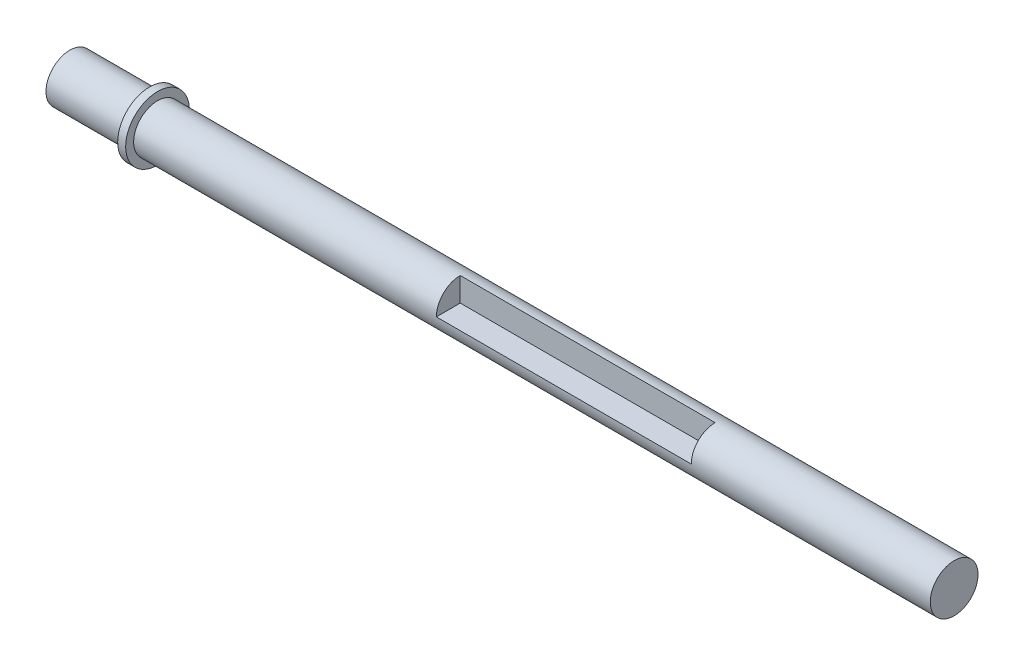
ISO-10303-21;
HEADER;
FILE_DESCRIPTION(('STEP AP214'),'2;1');
FILE_NAME('part.step','',(''),(''),'','','');
FILE_SCHEMA(('AUTOMOTIVE_DESIGN { 1 0 10303 214 1 1 1 1 }'));
ENDSEC;
DATA;
#1=APPLICATION_CONTEXT('core data for automotive mechanical design processes');
#2=APPLICATION_PROTOCOL_DEFINITION('international standard','automotive_design',2000,#1);
#3=PRODUCT_CONTEXT('',#1,'mechanical');
#4=PRODUCT('Part','Part','',(#3));
#5=PRODUCT_RELATED_PRODUCT_CATEGORY('part','',(#4));
#6=PRODUCT_DEFINITION_FORMATION('','',#4);
#7=PRODUCT_DEFINITION_CONTEXT('part definition',#1,'design');
#8=PRODUCT_DEFINITION('design','',#6,#7);
#9=PRODUCT_DEFINITION_SHAPE('','',#8);
#10=(LENGTH_UNIT() NAMED_UNIT(*) SI_UNIT(.MILLI.,.METRE.));
#11=(NAMED_UNIT(*) PLANE_ANGLE_UNIT() SI_UNIT($,.RADIAN.));
#12=(NAMED_UNIT(*) SI_UNIT($,.STERADIAN.) SOLID_ANGLE_UNIT());
#13=UNCERTAINTY_MEASURE_WITH_UNIT(LENGTH_MEASURE(1.E-05),#10,'distance_accuracy_value','');
#14=(GEOMETRIC_REPRESENTATION_CONTEXT(3) GLOBAL_UNCERTAINTY_ASSIGNED_CONTEXT((#13)) GLOBAL_UNIT_ASSIGNED_CONTEXT((#10,
#11,#12)) REPRESENTATION_CONTEXT('',''));
#15=CARTESIAN_POINT('',(0.,0.,0.));
#16=DIRECTION('',(0.,0.,1.));
#17=DIRECTION('',(1.,0.,0.));
#18=AXIS2_PLACEMENT_3D('',#15,#16,#17);
#19=CARTESIAN_POINT('',(0.,0.,0.));
#20=DIRECTION('',(-1.,0.,0.));
#21=DIRECTION('',(0.,0.,1.));
#22=AXIS2_PLACEMENT_3D('',#19,#20,#21);
#23=CYLINDRICAL_SURFACE('',#22,3.);
#24=CARTESIAN_POINT('',(111.,0.,0.));
#25=DIRECTION('',(-1.,0.,0.));
#26=DIRECTION('',(0.,0.,1.));
#27=AXIS2_PLACEMENT_3D('',#24,#25,#26);
#28=CIRCLE('',#27,3.);
#29=CARTESIAN_POINT('',(111.,0.,3.));
#30=VERTEX_POINT('',#29);
#31=EDGE_CURVE('E85',#30,#30,#28,.T.);
#32=ORIENTED_EDGE('',*,*,#31,.T.);
#33=EDGE_LOOP('',(#32));
#34=FACE_BOUND('',#33,.T.);
#35=CARTESIAN_POINT('',(11.,0.,0.));
#36=DIRECTION('',(-1.,0.,0.));
#37=DIRECTION('',(0.,0.,1.));
#38=AXIS2_PLACEMENT_3D('',#35,#36,#37);
#39=CIRCLE('',#38,3.);
#40=CARTESIAN_POINT('',(11.,0.,3.));
#41=VERTEX_POINT('',#40);
#42=EDGE_CURVE('E89',#41,#41,#39,.T.);
#43=ORIENTED_EDGE('',*,*,#42,.F.);
#44=EDGE_LOOP('',(#43));
#45=FACE_BOUND('',#44,.T.);
#46=CARTESIAN_POINT('',(49.,0.,0.));
#47=DIRECTION('',(1.,0.,0.));
#48=DIRECTION('',(0.,0.,-1.));
#49=AXIS2_PLACEMENT_3D('',#46,#47,#48);
#50=CIRCLE('',#49,3.);
#51=CARTESIAN_POINT('',(49.,3.,0.));
#52=VERTEX_POINT('',#51);
#53=CARTESIAN_POINT('',(49.,0.,3.));
#54=VERTEX_POINT('',#53);
#55=EDGE_CURVE('E68',#52,#54,#50,.T.);
#56=ORIENTED_EDGE('',*,*,#55,.F.);
#57=DIRECTION('',(1.,0.,0.));
#58=VECTOR('',#57,1.);
#59=CARTESIAN_POINT('',(49.,3.,0.));
#60=LINE('',#59,#58);
#61=CARTESIAN_POINT('',(81.,3.,0.));
#62=VERTEX_POINT('',#61);
#63=EDGE_CURVE('E67',#52,#62,#60,.T.);
#64=ORIENTED_EDGE('',*,*,#63,.T.);
#65=CARTESIAN_POINT('',(81.,0.,0.));
#66=DIRECTION('',(1.,0.,0.));
#67=DIRECTION('',(0.,0.,-1.));
#68=AXIS2_PLACEMENT_3D('',#65,#66,#67);
#69=CIRCLE('',#68,3.);
#70=CARTESIAN_POINT('',(81.,0.,3.));
#71=VERTEX_POINT('',#70);
#72=EDGE_CURVE('E72',#62,#71,#69,.T.);
#73=ORIENTED_EDGE('',*,*,#72,.T.);
#74=DIRECTION('',(1.,0.,0.));
#75=VECTOR('',#74,1.);
#76=CARTESIAN_POINT('',(49.,0.,3.));
#77=LINE('',#76,#75);
#78=EDGE_CURVE('E77',#54,#71,#77,.T.);
#79=ORIENTED_EDGE('',*,*,#78,.F.);
#80=EDGE_LOOP('',(#56,#64,#73,#79));
#81=FACE_BOUND('',#80,.T.);
#82=ADVANCED_FACE('F26',(#34,#45,#81),#23,.T.);
#83=CARTESIAN_POINT('',(0.,0.,0.));
#84=DIRECTION('',(1.,0.,0.));
#85=DIRECTION('',(0.,0.,-1.));
#86=AXIS2_PLACEMENT_3D('',#83,#84,#85);
#87=PLANE('',#86);
#88=CARTESIAN_POINT('',(0.,0.,0.));
#89=DIRECTION('',(-1.,0.,0.));
#90=DIRECTION('',(0.,0.,1.));
#91=AXIS2_PLACEMENT_3D('',#88,#89,#90);
#92=CIRCLE('',#91,3.);
#93=CARTESIAN_POINT('',(0.,0.,3.));
#94=VERTEX_POINT('',#93);
#95=EDGE_CURVE('E11',#94,#94,#92,.T.);
#96=ORIENTED_EDGE('',*,*,#95,.T.);
#97=EDGE_LOOP('',(#96));
#98=FACE_BOUND('',#97,.T.);
#99=ADVANCED_FACE('F28',(#98),#87,.F.);
#100=CARTESIAN_POINT('',(0.,0.,0.));
#101=DIRECTION('',(-1.,0.,0.));
#102=DIRECTION('',(0.,0.,1.));
#103=AXIS2_PLACEMENT_3D('',#100,#101,#102);
#104=CYLINDRICAL_SURFACE('',#103,3.);
#105=ORIENTED_EDGE('',*,*,#95,.F.);
#106=EDGE_LOOP('',(#105));
#107=FACE_BOUND('',#106,.T.);
#108=CARTESIAN_POINT('',(10.,0.,0.));
#109=DIRECTION('',(-1.,0.,0.));
#110=DIRECTION('',(0.,0.,1.));
#111=AXIS2_PLACEMENT_3D('',#108,#109,#110);
#112=CIRCLE('',#111,3.);
#113=CARTESIAN_POINT('',(10.,0.,3.));
#114=VERTEX_POINT('',#113);
#115=EDGE_CURVE('E34',#114,#114,#112,.T.);
#116=ORIENTED_EDGE('',*,*,#115,.T.);
#117=EDGE_LOOP('',(#116));
#118=FACE_BOUND('',#117,.T.);
#119=ADVANCED_FACE('F100',(#107,#118),#104,.T.);
#120=CARTESIAN_POINT('',(10.,3.,0.));
#121=DIRECTION('',(1.,0.,0.));
#122=DIRECTION('',(0.,0.,-1.));
#123=AXIS2_PLACEMENT_3D('',#120,#121,#122);
#124=PLANE('',#123);
#125=ORIENTED_EDGE('',*,*,#115,.F.);
#126=EDGE_LOOP('',(#125));
#127=FACE_BOUND('',#126,.T.);
#128=CARTESIAN_POINT('',(10.,0.,0.));
#129=DIRECTION('',(-1.,0.,0.));
#130=DIRECTION('',(0.,0.,1.));
#131=AXIS2_PLACEMENT_3D('',#128,#129,#130);
#132=CIRCLE('',#131,4.);
#133=CARTESIAN_POINT('',(10.,0.,4.));
#134=VERTEX_POINT('',#133);
#135=EDGE_CURVE('E95',#134,#134,#132,.T.);
#136=ORIENTED_EDGE('',*,*,#135,.T.);
#137=EDGE_LOOP('',(#136));
#138=FACE_BOUND('',#137,.T.);
#139=ADVANCED_FACE('F102',(#127,#138),#124,.F.);
#140=CARTESIAN_POINT('',(0.,0.,0.));
#141=DIRECTION('',(-1.,0.,0.));
#142=DIRECTION('',(0.,0.,1.));
#143=AXIS2_PLACEMENT_3D('',#140,#141,#142);
#144=CYLINDRICAL_SURFACE('',#143,4.);
#145=ORIENTED_EDGE('',*,*,#135,.F.);
#146=EDGE_LOOP('',(#145));
#147=FACE_BOUND('',#146,.T.);
#148=CARTESIAN_POINT('',(11.,0.,0.));
#149=DIRECTION('',(-1.,0.,0.));
#150=DIRECTION('',(0.,0.,1.));
#151=AXIS2_PLACEMENT_3D('',#148,#149,#150);
#152=CIRCLE('',#151,4.);
#153=CARTESIAN_POINT('',(11.,0.,4.));
#154=VERTEX_POINT('',#153);
#155=EDGE_CURVE('E92',#154,#154,#152,.T.);
#156=ORIENTED_EDGE('',*,*,#155,.T.);
#157=EDGE_LOOP('',(#156));
#158=FACE_BOUND('',#157,.T.);
#159=ADVANCED_FACE('F105',(#147,#158),#144,.T.);
#160=CARTESIAN_POINT('',(11.,4.,0.));
#161=DIRECTION('',(-1.,0.,0.));
#162=DIRECTION('',(0.,0.,1.));
#163=AXIS2_PLACEMENT_3D('',#160,#161,#162);
#164=PLANE('',#163);
#165=ORIENTED_EDGE('',*,*,#155,.F.);
#166=EDGE_LOOP('',(#165));
#167=FACE_BOUND('',#166,.T.);
#168=ORIENTED_EDGE('',*,*,#42,.T.);
#169=EDGE_LOOP('',(#168));
#170=FACE_BOUND('',#169,.T.);
#171=ADVANCED_FACE('F111',(#167,#170),#164,.F.);
#172=CARTESIAN_POINT('',(111.,3.,0.));
#173=DIRECTION('',(-1.,0.,0.));
#174=DIRECTION('',(0.,0.,1.));
#175=AXIS2_PLACEMENT_3D('',#172,#173,#174);
#176=PLANE('',#175);
#177=ORIENTED_EDGE('',*,*,#31,.F.);
#178=EDGE_LOOP('',(#177));
#179=FACE_BOUND('',#178,.T.);
#180=ADVANCED_FACE('F117',(#179),#176,.F.);
#181=CARTESIAN_POINT('',(49.,0.,0.));
#182=DIRECTION('',(0.,-1.,0.));
#183=DIRECTION('',(0.,0.,-1.));
#184=AXIS2_PLACEMENT_3D('',#181,#182,#183);
#185=PLANE('',#184);
#186=DIRECTION('',(0.,0.,-1.));
#187=VECTOR('',#186,1.);
#188=CARTESIAN_POINT('',(81.,0.,0.));
#189=LINE('',#188,#187);
#190=CARTESIAN_POINT('',(81.,0.,0.));
#191=VERTEX_POINT('',#190);
#192=EDGE_CURVE('E41',#71,#191,#189,.T.);
#193=ORIENTED_EDGE('',*,*,#192,.T.);
#194=DIRECTION('',(1.,0.,0.));
#195=VECTOR('',#194,1.);
#196=CARTESIAN_POINT('',(49.,0.,0.));
#197=LINE('',#196,#195);
#198=CARTESIAN_POINT('',(49.,0.,0.));
#199=VERTEX_POINT('',#198);
#200=EDGE_CURVE('E62',#199,#191,#197,.T.);
#201=ORIENTED_EDGE('',*,*,#200,.F.);
#202=DIRECTION('',(0.,0.,-1.));
#203=VECTOR('',#202,1.);
#204=CARTESIAN_POINT('',(49.,0.,0.));
#205=LINE('',#204,#203);
#206=EDGE_CURVE('E48',#54,#199,#205,.T.);
#207=ORIENTED_EDGE('',*,*,#206,.F.);
#208=ORIENTED_EDGE('',*,*,#78,.T.);
#209=EDGE_LOOP('',(#193,#201,#207,#208));
#210=FACE_BOUND('',#209,.T.);
#211=ADVANCED_FACE('F75',(#210),#185,.F.);
#212=CARTESIAN_POINT('',(49.,0.,0.));
#213=DIRECTION('',(0.,0.,-1.));
#214=DIRECTION('',(-1.,0.,0.));
#215=AXIS2_PLACEMENT_3D('',#212,#213,#214);
#216=PLANE('',#215);
#217=DIRECTION('',(0.,1.,0.));
#218=VECTOR('',#217,1.);
#219=CARTESIAN_POINT('',(81.,0.,0.));
#220=LINE('',#219,#218);
#221=EDGE_CURVE('E64',#191,#62,#220,.T.);
#222=ORIENTED_EDGE('',*,*,#221,.T.);
#223=ORIENTED_EDGE('',*,*,#63,.F.);
#224=DIRECTION('',(0.,1.,0.));
#225=VECTOR('',#224,1.);
#226=CARTESIAN_POINT('',(49.,0.,0.));
#227=LINE('',#226,#225);
#228=EDGE_CURVE('E66',#199,#52,#227,.T.);
#229=ORIENTED_EDGE('',*,*,#228,.F.);
#230=ORIENTED_EDGE('',*,*,#200,.T.);
#231=EDGE_LOOP('',(#222,#223,#229,#230));
#232=FACE_BOUND('',#231,.T.);
#233=ADVANCED_FACE('F63',(#232),#216,.F.);
#234=CARTESIAN_POINT('',(49.,0.,0.));
#235=DIRECTION('',(1.,0.,0.));
#236=DIRECTION('',(0.,0.,-1.));
#237=AXIS2_PLACEMENT_3D('',#234,#235,#236);
#238=PLANE('',#237);
#239=ORIENTED_EDGE('',*,*,#206,.T.);
#240=ORIENTED_EDGE('',*,*,#228,.T.);
#241=ORIENTED_EDGE('',*,*,#55,.T.);
#242=EDGE_LOOP('',(#239,#240,#241));
#243=FACE_BOUND('',#242,.T.);
#244=ADVANCED_FACE('F127',(#243),#238,.T.);
#245=CARTESIAN_POINT('',(81.,0.,0.));
#246=DIRECTION('',(1.,0.,0.));
#247=DIRECTION('',(0.,0.,-1.));
#248=AXIS2_PLACEMENT_3D('',#245,#246,#247);
#249=PLANE('',#248);
#250=ORIENTED_EDGE('',*,*,#192,.F.);
#251=ORIENTED_EDGE('',*,*,#72,.F.);
#252=ORIENTED_EDGE('',*,*,#221,.F.);
#253=EDGE_LOOP('',(#250,#251,#252));
#254=FACE_BOUND('',#253,.T.);
#255=ADVANCED_FACE('F70',(#254),#249,.F.);
#256=CLOSED_SHELL('',(#82,#99,#119,#139,#159,#171,#180,#211,#233,#244,#255));
#257=MANIFOLD_SOLID_BREP('B2',#256);
#258=ADVANCED_BREP_SHAPE_REPRESENTATION('',(#18,#257),#14);
#259=SHAPE_DEFINITION_REPRESENTATION(#9,#258);
ENDSEC;
END-ISO-10303-21;
